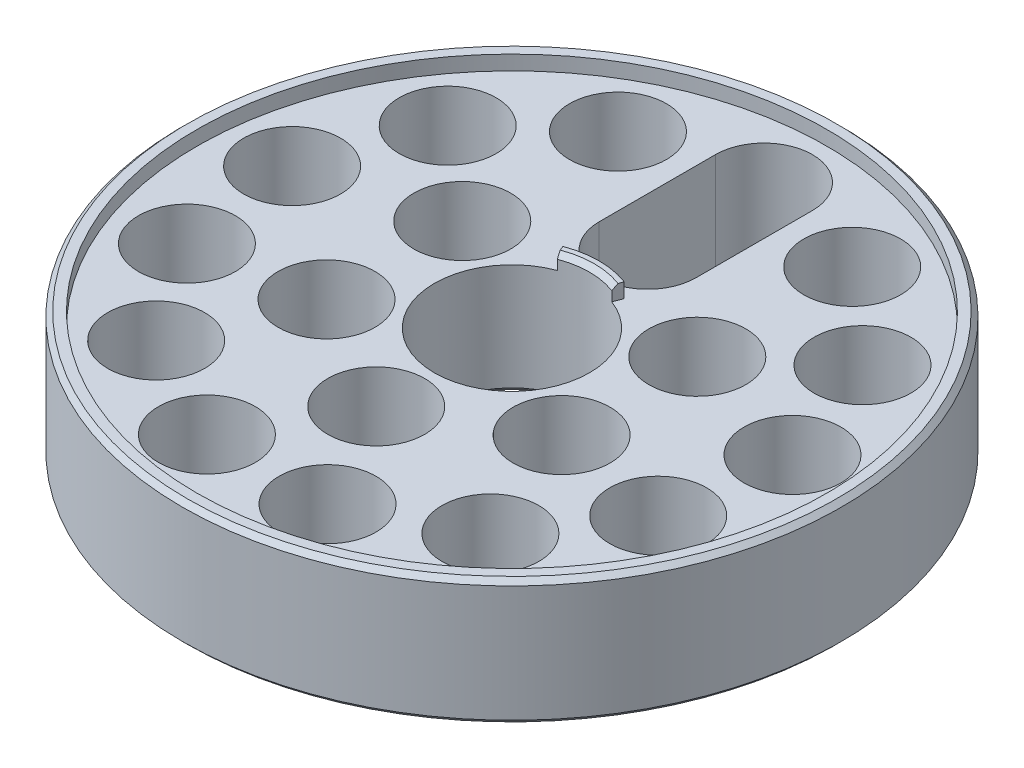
ISO-10303-21;
HEADER;
FILE_DESCRIPTION(('STEP AP214'),'2;1');
FILE_NAME('part.step','',(''),(''),'','','');
FILE_SCHEMA(('AUTOMOTIVE_DESIGN { 1 0 10303 214 1 1 1 1 }'));
ENDSEC;
DATA;
#1=APPLICATION_CONTEXT('core data for automotive mechanical design processes');
#2=APPLICATION_PROTOCOL_DEFINITION('international standard','automotive_design',2000,#1);
#3=PRODUCT_CONTEXT('',#1,'mechanical');
#4=PRODUCT('Part','Part','',(#3));
#5=PRODUCT_RELATED_PRODUCT_CATEGORY('part','',(#4));
#6=PRODUCT_DEFINITION_FORMATION('','',#4);
#7=PRODUCT_DEFINITION_CONTEXT('part definition',#1,'design');
#8=PRODUCT_DEFINITION('design','',#6,#7);
#9=PRODUCT_DEFINITION_SHAPE('','',#8);
#10=(LENGTH_UNIT() NAMED_UNIT(*) SI_UNIT(.MILLI.,.METRE.));
#11=(NAMED_UNIT(*) PLANE_ANGLE_UNIT() SI_UNIT($,.RADIAN.));
#12=(NAMED_UNIT(*) SI_UNIT($,.STERADIAN.) SOLID_ANGLE_UNIT());
#13=UNCERTAINTY_MEASURE_WITH_UNIT(LENGTH_MEASURE(1.E-05),#10,'distance_accuracy_value','');
#14=(GEOMETRIC_REPRESENTATION_CONTEXT(3) GLOBAL_UNCERTAINTY_ASSIGNED_CONTEXT((#13)) GLOBAL_UNIT_ASSIGNED_CONTEXT((#10,
#11,#12)) REPRESENTATION_CONTEXT('',''));
#15=CARTESIAN_POINT('',(0.,0.,0.));
#16=DIRECTION('',(0.,0.,1.));
#17=DIRECTION('',(1.,0.,0.));
#18=AXIS2_PLACEMENT_3D('',#15,#16,#17);
#19=CARTESIAN_POINT('',(0.,0.,0.));
#20=DIRECTION('',(0.,1.,0.));
#21=DIRECTION('',(0.,0.,1.));
#22=AXIS2_PLACEMENT_3D('',#19,#20,#21);
#23=PLANE('',#22);
#24=DIRECTION('',(0.351123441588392,0.,0.936329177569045));
#25=VECTOR('',#24,1.);
#26=CARTESIAN_POINT('',(-2.80898753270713,0.,-7.49063342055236));
#27=LINE('',#26,#25);
#28=CARTESIAN_POINT('',(-3.16011097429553,0.,-8.4269625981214));
#29=VERTEX_POINT('',#28);
#30=CARTESIAN_POINT('',(-2.98454925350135,0.,-7.95879800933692));
#31=VERTEX_POINT('',#30);
#32=EDGE_CURVE('E191',#29,#31,#27,.T.);
#33=ORIENTED_EDGE('',*,*,#32,.T.);
#34=CARTESIAN_POINT('',(0.,0.,0.));
#35=DIRECTION('',(0.,1.,0.));
#36=DIRECTION('',(0.,0.,1.));
#37=AXIS2_PLACEMENT_3D('',#34,#35,#36);
#38=CIRCLE('',#37,8.50000000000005);
#39=CARTESIAN_POINT('',(2.98454925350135,0.,-7.95879800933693));
#40=VERTEX_POINT('',#39);
#41=EDGE_CURVE('E58',#31,#40,#38,.F.);
#42=ORIENTED_EDGE('',*,*,#41,.T.);
#43=DIRECTION('',(0.351123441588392,0.,-0.936329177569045));
#44=VECTOR('',#43,1.);
#45=CARTESIAN_POINT('',(2.80898753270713,0.,-7.49063342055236));
#46=LINE('',#45,#44);
#47=CARTESIAN_POINT('',(3.16011097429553,0.,-8.4269625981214));
#48=VERTEX_POINT('',#47);
#49=EDGE_CURVE('E188',#40,#48,#46,.T.);
#50=ORIENTED_EDGE('',*,*,#49,.T.);
#51=CARTESIAN_POINT('',(0.,0.,0.));
#52=DIRECTION('',(0.,1.,0.));
#53=DIRECTION('',(0.,0.,1.));
#54=AXIS2_PLACEMENT_3D('',#51,#52,#53);
#55=CIRCLE('',#54,9.);
#56=EDGE_CURVE('E193',#48,#29,#55,.T.);
#57=ORIENTED_EDGE('',*,*,#56,.T.);
#58=EDGE_LOOP('',(#33,#42,#50,#57));
#59=FACE_BOUND('',#58,.T.);
#60=ADVANCED_FACE('F33',(#59),#23,.T.);
#61=CARTESIAN_POINT('',(0.,-13.,0.));
#62=DIRECTION('',(0.,1.,0.));
#63=DIRECTION('',(0.,0.,1.));
#64=AXIS2_PLACEMENT_3D('',#61,#62,#63);
#65=CYLINDRICAL_SURFACE('',#64,8.);
#66=CARTESIAN_POINT('',(0.,-12.5000000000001,0.));
#67=DIRECTION('',(0.,1.,0.));
#68=DIRECTION('',(0.,0.,1.));
#69=AXIS2_PLACEMENT_3D('',#66,#67,#68);
#70=CIRCLE('',#69,8.);
#71=CARTESIAN_POINT('',(0.,-12.5000000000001,8.));
#72=VERTEX_POINT('',#71);
#73=EDGE_CURVE('E167',#72,#72,#70,.F.);
#74=ORIENTED_EDGE('',*,*,#73,.T.);
#75=EDGE_LOOP('',(#74));
#76=FACE_BOUND('',#75,.T.);
#77=DIRECTION('',(0.,1.,0.));
#78=VECTOR('',#77,1.);
#79=CARTESIAN_POINT('',(2.80898753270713,-1.5,-7.49063342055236));
#80=LINE('',#79,#78);
#81=CARTESIAN_POINT('',(2.80898753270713,-1.5,-7.49063342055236));
#82=VERTEX_POINT('',#81);
#83=CARTESIAN_POINT('',(2.80898753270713,-0.500000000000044,-7.49063342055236));
#84=VERTEX_POINT('',#83);
#85=EDGE_CURVE('E174',#82,#84,#80,.T.);
#86=ORIENTED_EDGE('',*,*,#85,.T.);
#87=CARTESIAN_POINT('',(0.,-0.500000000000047,0.));
#88=DIRECTION('',(0.,1.,0.));
#89=DIRECTION('',(0.,0.,1.));
#90=AXIS2_PLACEMENT_3D('',#87,#88,#89);
#91=CIRCLE('',#90,8.);
#92=CARTESIAN_POINT('',(-2.80898753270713,-0.500000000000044,-7.49063342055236));
#93=VERTEX_POINT('',#92);
#94=EDGE_CURVE('E164',#84,#93,#91,.T.);
#95=ORIENTED_EDGE('',*,*,#94,.T.);
#96=DIRECTION('',(0.,1.,0.));
#97=VECTOR('',#96,1.);
#98=CARTESIAN_POINT('',(-2.80898753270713,-1.5,-7.49063342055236));
#99=LINE('',#98,#97);
#100=CARTESIAN_POINT('',(-2.80898753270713,-1.5,-7.49063342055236));
#101=VERTEX_POINT('',#100);
#102=EDGE_CURVE('E183',#101,#93,#99,.T.);
#103=ORIENTED_EDGE('',*,*,#102,.F.);
#104=CARTESIAN_POINT('',(0.,-1.5,0.));
#105=DIRECTION('',(0.,1.,0.));
#106=DIRECTION('',(0.,0.,1.));
#107=AXIS2_PLACEMENT_3D('',#104,#105,#106);
#108=CIRCLE('',#107,8.);
#109=EDGE_CURVE('E181',#101,#82,#108,.T.);
#110=ORIENTED_EDGE('',*,*,#109,.T.);
#111=EDGE_LOOP('',(#86,#95,#103,#110));
#112=FACE_BOUND('',#111,.T.);
#113=ADVANCED_FACE('F337',(#76,#112),#65,.F.);
#114=CARTESIAN_POINT('',(0.,-13.,0.));
#115=DIRECTION('',(0.,1.,0.));
#116=DIRECTION('',(0.,0.,1.));
#117=AXIS2_PLACEMENT_3D('',#114,#115,#116);
#118=CYLINDRICAL_SURFACE('',#117,34.);
#119=CARTESIAN_POINT('',(0.,-12.5,0.));
#120=DIRECTION('',(0.,1.,0.));
#121=DIRECTION('',(0.,0.,1.));
#122=AXIS2_PLACEMENT_3D('',#119,#120,#121);
#123=CIRCLE('',#122,34.);
#124=CARTESIAN_POINT('',(0.,-12.5,34.));
#125=VERTEX_POINT('',#124);
#126=EDGE_CURVE('E42',#125,#125,#123,.T.);
#127=CARTESIAN_POINT('',(0.,-0.499999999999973,0.));
#128=DIRECTION('',(0.,1.,0.));
#129=DIRECTION('',(0.,0.,1.));
#130=AXIS2_PLACEMENT_3D('',#127,#128,#129);
#131=CIRCLE('',#130,34.);
#132=CARTESIAN_POINT('',(0.,-0.499999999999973,34.));
#133=VERTEX_POINT('',#132);
#134=EDGE_CURVE('E150',#133,#133,#131,.F.);
#135=CARTESIAN_POINT('',(0.,-12.5,34.));
#136=CARTESIAN_POINT('',(0.,-12.375,34.));
#137=CARTESIAN_POINT('',(0.,-12.25,34.));
#138=CARTESIAN_POINT('',(0.,-12.,34.));
#139=CARTESIAN_POINT('',(0.,-11.875,34.));
#140=CARTESIAN_POINT('',(0.,-11.625,34.));
#141=CARTESIAN_POINT('',(0.,-11.5,34.));
#142=CARTESIAN_POINT('',(0.,-11.25,34.));
#143=CARTESIAN_POINT('',(0.,-11.125,34.));
#144=CARTESIAN_POINT('',(0.,-10.875,34.));
#145=CARTESIAN_POINT('',(0.,-10.75,34.));
#146=CARTESIAN_POINT('',(0.,-10.5,34.));
#147=CARTESIAN_POINT('',(0.,-10.375,34.));
#148=CARTESIAN_POINT('',(0.,-10.125,34.));
#149=CARTESIAN_POINT('',(0.,-9.99999999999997,34.));
#150=CARTESIAN_POINT('',(0.,-9.74999999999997,34.));
#151=CARTESIAN_POINT('',(0.,-9.62499999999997,34.));
#152=CARTESIAN_POINT('',(0.,-9.37499999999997,34.));
#153=CARTESIAN_POINT('',(0.,-9.24999999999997,34.));
#154=CARTESIAN_POINT('',(0.,-8.99999999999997,34.));
#155=CARTESIAN_POINT('',(0.,-8.87499999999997,34.));
#156=CARTESIAN_POINT('',(0.,-8.62499999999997,34.));
#157=CARTESIAN_POINT('',(0.,-8.49999999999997,34.));
#158=CARTESIAN_POINT('',(0.,-8.24999999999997,34.));
#159=CARTESIAN_POINT('',(0.,-8.12499999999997,34.));
#160=CARTESIAN_POINT('',(0.,-7.87499999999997,34.));
#161=CARTESIAN_POINT('',(0.,-7.74999999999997,34.));
#162=CARTESIAN_POINT('',(0.,-7.49999999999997,34.));
#163=CARTESIAN_POINT('',(0.,-7.37499999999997,34.));
#164=CARTESIAN_POINT('',(0.,-7.12499999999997,34.));
#165=CARTESIAN_POINT('',(0.,-6.99999999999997,34.));
#166=CARTESIAN_POINT('',(0.,-6.74999999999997,34.));
#167=CARTESIAN_POINT('',(0.,-6.62499999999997,34.));
#168=CARTESIAN_POINT('',(0.,-6.37499999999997,34.));
#169=CARTESIAN_POINT('',(0.,-6.24999999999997,34.));
#170=CARTESIAN_POINT('',(0.,-5.99999999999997,34.));
#171=CARTESIAN_POINT('',(0.,-5.87499999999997,34.));
#172=CARTESIAN_POINT('',(0.,-5.62499999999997,34.));
#173=CARTESIAN_POINT('',(0.,-5.49999999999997,34.));
#174=CARTESIAN_POINT('',(0.,-5.24999999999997,34.));
#175=CARTESIAN_POINT('',(0.,-5.12499999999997,34.));
#176=CARTESIAN_POINT('',(0.,-4.87499999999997,34.));
#177=CARTESIAN_POINT('',(0.,-4.74999999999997,34.));
#178=CARTESIAN_POINT('',(0.,-4.49999999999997,34.));
#179=CARTESIAN_POINT('',(0.,-4.37499999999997,34.));
#180=CARTESIAN_POINT('',(0.,-4.12499999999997,34.));
#181=CARTESIAN_POINT('',(0.,-3.99999999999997,34.));
#182=CARTESIAN_POINT('',(0.,-3.74999999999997,34.));
#183=CARTESIAN_POINT('',(0.,-3.62499999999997,34.));
#184=CARTESIAN_POINT('',(0.,-3.37499999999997,34.));
#185=CARTESIAN_POINT('',(0.,-3.24999999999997,34.));
#186=CARTESIAN_POINT('',(0.,-2.99999999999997,34.));
#187=CARTESIAN_POINT('',(0.,-2.87499999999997,34.));
#188=CARTESIAN_POINT('',(0.,-2.62499999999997,34.));
#189=CARTESIAN_POINT('',(0.,-2.49999999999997,34.));
#190=CARTESIAN_POINT('',(0.,-2.24999999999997,34.));
#191=CARTESIAN_POINT('',(0.,-2.12499999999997,34.));
#192=CARTESIAN_POINT('',(0.,-1.87499999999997,34.));
#193=CARTESIAN_POINT('',(0.,-1.74999999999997,34.));
#194=CARTESIAN_POINT('',(0.,-1.49999999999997,34.));
#195=CARTESIAN_POINT('',(0.,-1.37499999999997,34.));
#196=CARTESIAN_POINT('',(0.,-1.12499999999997,34.));
#197=CARTESIAN_POINT('',(0.,-0.999999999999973,34.));
#198=CARTESIAN_POINT('',(0.,-0.749999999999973,34.));
#199=CARTESIAN_POINT('',(0.,-0.624999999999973,34.));
#200=CARTESIAN_POINT('',(0.,-0.499999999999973,34.));
#201=B_SPLINE_CURVE_WITH_KNOTS('',3,(#135,#136,#137,#138,#139,#140,#141,#142,#143,#144,#145,
#146,#147,#148,#149,#150,#151,#152,#153,#154,#155,#156,#157,#158,#159,#160,#161,#162,#163,#164,
#165,#166,#167,#168,#169,#170,#171,#172,#173,#174,#175,#176,#177,#178,#179,#180,#181,#182,#183,
#184,#185,#186,#187,#188,#189,#190,#191,#192,#193,#194,#195,#196,#197,#198,#199,#200),
.UNSPECIFIED.,.F.,.F.,(4,2,2,2,2,2,2,2,2,2,2,2,2,2,2,2,2,2,2,2,2,2,2,2,2,2,2,2,2,2,2,2,4),(0.,
0.374999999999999,0.749999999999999,1.125,1.5,1.875,2.25,2.625,3.,3.375,3.75,4.125,4.5,4.875,
5.25,5.625,6.,6.375,6.75,7.125,7.5,7.875,8.25,8.625,9.,9.375,9.75,10.125,10.5,10.875,11.25,
11.625,12.),.UNSPECIFIED.);
#202=EDGE_CURVE('BSEAM343',#125,#133,#201,.T.);
#203=ORIENTED_EDGE('',*,*,#126,.T.);
#204=ORIENTED_EDGE('',*,*,#134,.T.);
#205=ORIENTED_EDGE('',*,*,#202,.T.);
#206=ORIENTED_EDGE('',*,*,#202,.F.);
#207=EDGE_LOOP('',(#203,#205,#204,#206));
#208=FACE_BOUND('',#207,.T.);
#209=ADVANCED_FACE('F343',(#208),#118,.T.);
#210=CARTESIAN_POINT('',(0.,-13.,0.));
#211=DIRECTION('',(0.,1.,0.));
#212=DIRECTION('',(0.,0.,1.));
#213=AXIS2_PLACEMENT_3D('',#210,#211,#212);
#214=PLANE('',#213);
#215=CARTESIAN_POINT('',(0.,-13.,-14.));
#216=DIRECTION('',(0.,1.,0.));
#217=DIRECTION('',(0.,0.,1.));
#218=AXIS2_PLACEMENT_3D('',#215,#216,#217);
#219=CIRCLE('',#218,5.);
#220=CARTESIAN_POINT('',(0.,-13.,-9.));
#221=VERTEX_POINT('',#220);
#222=EDGE_CURVE('E120',#221,#221,#219,.T.);
#223=ORIENTED_EDGE('',*,*,#222,.T.);
#224=EDGE_LOOP('',(#223));
#225=FACE_BOUND('',#224,.T.);
#226=CARTESIAN_POINT('',(0.,-13.,0.));
#227=DIRECTION('',(0.,1.,0.));
#228=DIRECTION('',(0.,0.,1.));
#229=AXIS2_PLACEMENT_3D('',#226,#227,#228);
#230=CIRCLE('',#229,8.49999999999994);
#231=CARTESIAN_POINT('',(0.,-13.,8.49999999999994));
#232=VERTEX_POINT('',#231);
#233=EDGE_CURVE('E153',#232,#232,#230,.T.);
#234=ORIENTED_EDGE('',*,*,#233,.T.);
#235=EDGE_LOOP('',(#234));
#236=FACE_BOUND('',#235,.T.);
#237=CARTESIAN_POINT('',(0.,-13.,0.));
#238=DIRECTION('',(0.,1.,0.));
#239=DIRECTION('',(0.,0.,1.));
#240=AXIS2_PLACEMENT_3D('',#237,#238,#239);
#241=CIRCLE('',#240,33.5);
#242=CARTESIAN_POINT('',(0.,-13.,33.5));
#243=VERTEX_POINT('',#242);
#244=EDGE_CURVE('E156',#243,#243,#241,.F.);
#245=ORIENTED_EDGE('',*,*,#244,.T.);
#246=EDGE_LOOP('',(#245));
#247=FACE_BOUND('',#246,.T.);
#248=ADVANCED_FACE('F323',(#225,#236,#247),#214,.F.);
#249=CARTESIAN_POINT('',(0.,0.,0.));
#250=DIRECTION('',(0.,1.,0.));
#251=DIRECTION('',(0.,0.,1.));
#252=AXIS2_PLACEMENT_3D('',#249,#250,#251);
#253=CIRCLE('',#252,33.5);
#254=CARTESIAN_POINT('',(0.,0.,33.5));
#255=VERTEX_POINT('',#254);
#256=EDGE_CURVE('E11',#255,#255,#253,.T.);
#257=ORIENTED_EDGE('',*,*,#256,.T.);
#258=EDGE_LOOP('',(#257));
#259=FACE_BOUND('',#258,.T.);
#260=CARTESIAN_POINT('',(0.,0.,0.));
#261=DIRECTION('',(0.,1.,0.));
#262=DIRECTION('',(0.,0.,1.));
#263=AXIS2_PLACEMENT_3D('',#260,#261,#262);
#264=CIRCLE('',#263,32.5);
#265=CARTESIAN_POINT('',(0.,0.,32.5));
#266=VERTEX_POINT('',#265);
#267=EDGE_CURVE('E171',#266,#266,#264,.T.);
#268=ORIENTED_EDGE('',*,*,#267,.F.);
#269=EDGE_LOOP('',(#268));
#270=FACE_BOUND('',#269,.T.);
#271=ADVANCED_FACE('F339',(#259,#270),#23,.T.);
#272=CARTESIAN_POINT('',(0.,-1.5,0.));
#273=DIRECTION('',(0.,1.,0.));
#274=DIRECTION('',(0.,0.,1.));
#275=AXIS2_PLACEMENT_3D('',#272,#273,#274);
#276=CYLINDRICAL_SURFACE('',#275,32.5);
#277=CARTESIAN_POINT('',(0.,-1.5,0.));
#278=DIRECTION('',(0.,1.,0.));
#279=DIRECTION('',(0.,0.,1.));
#280=AXIS2_PLACEMENT_3D('',#277,#278,#279);
#281=CIRCLE('',#280,32.5);
#282=CARTESIAN_POINT('',(0.,-1.5,32.5));
#283=VERTEX_POINT('',#282);
#284=EDGE_CURVE('E170',#283,#283,#281,.T.);
#285=ORIENTED_EDGE('',*,*,#284,.F.);
#286=EDGE_LOOP('',(#285));
#287=FACE_BOUND('',#286,.T.);
#288=ORIENTED_EDGE('',*,*,#267,.T.);
#289=EDGE_LOOP('',(#288));
#290=FACE_BOUND('',#289,.T.);
#291=ADVANCED_FACE('F349',(#287,#290),#276,.F.);
#292=CARTESIAN_POINT('',(0.,-1.5,0.));
#293=DIRECTION('',(0.,1.,0.));
#294=DIRECTION('',(0.,0.,1.));
#295=AXIS2_PLACEMENT_3D('',#292,#293,#294);
#296=PLANE('',#295);
#297=CARTESIAN_POINT('',(-12.1243556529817,-1.5,-6.9999999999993));
#298=DIRECTION('',(0.,1.,0.));
#299=DIRECTION('',(0.,0.,1.));
#300=AXIS2_PLACEMENT_3D('',#297,#298,#299);
#301=CIRCLE('',#300,5.00000000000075);
#302=CARTESIAN_POINT('',(-12.1243556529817,-1.5,-1.99999999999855));
#303=VERTEX_POINT('',#302);
#304=EDGE_CURVE('E313',#303,#303,#301,.T.);
#305=ORIENTED_EDGE('',*,*,#304,.F.);
#306=EDGE_LOOP('',(#305));
#307=FACE_BOUND('',#306,.T.);
#308=CARTESIAN_POINT('',(-12.1243556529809,-1.5,7.00000000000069));
#309=DIRECTION('',(0.,1.,0.));
#310=DIRECTION('',(0.,0.,1.));
#311=AXIS2_PLACEMENT_3D('',#308,#309,#310);
#312=CIRCLE('',#311,5.00000000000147);
#313=CARTESIAN_POINT('',(-12.1243556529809,-1.5,12.0000000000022));
#314=VERTEX_POINT('',#313);
#315=EDGE_CURVE('E307',#314,#314,#312,.T.);
#316=ORIENTED_EDGE('',*,*,#315,.F.);
#317=EDGE_LOOP('',(#316));
#318=FACE_BOUND('',#317,.T.);
#319=CARTESIAN_POINT('',(1.58818671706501E-12,-1.5,14.));
#320=DIRECTION('',(0.,1.,0.));
#321=DIRECTION('',(0.,0.,1.));
#322=AXIS2_PLACEMENT_3D('',#319,#320,#321);
#323=CIRCLE('',#322,5.00000000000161);
#324=CARTESIAN_POINT('',(1.58818671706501E-12,-1.5,19.0000000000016));
#325=VERTEX_POINT('',#324);
#326=EDGE_CURVE('E301',#325,#325,#323,.T.);
#327=ORIENTED_EDGE('',*,*,#326,.F.);
#328=EDGE_LOOP('',(#327));
#329=FACE_BOUND('',#328,.T.);
#330=CARTESIAN_POINT('',(12.1243556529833,-1.5,6.99999999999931));
#331=DIRECTION('',(0.,1.,0.));
#332=DIRECTION('',(0.,0.,1.));
#333=AXIS2_PLACEMENT_3D('',#330,#331,#332);
#334=CIRCLE('',#333,5.000000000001);
#335=CARTESIAN_POINT('',(12.1243556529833,-1.5,12.0000000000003));
#336=VERTEX_POINT('',#335);
#337=EDGE_CURVE('E295',#336,#336,#334,.T.);
#338=ORIENTED_EDGE('',*,*,#337,.F.);
#339=EDGE_LOOP('',(#338));
#340=FACE_BOUND('',#339,.T.);
#341=CARTESIAN_POINT('',(12.1243556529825,-1.5,-7.00000000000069));
#342=DIRECTION('',(0.,1.,0.));
#343=DIRECTION('',(0.,0.,1.));
#344=AXIS2_PLACEMENT_3D('',#341,#342,#343);
#345=CIRCLE('',#344,5.00000000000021);
#346=CARTESIAN_POINT('',(12.1243556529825,-1.5,-2.00000000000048));
#347=VERTEX_POINT('',#346);
#348=EDGE_CURVE('E289',#347,#347,#345,.T.);
#349=ORIENTED_EDGE('',*,*,#348,.F.);
#350=EDGE_LOOP('',(#349));
#351=FACE_BOUND('',#350,.T.);
#352=DIRECTION('',(0.,0.,-1.));
#353=VECTOR('',#352,1.);
#354=CARTESIAN_POINT('',(5.00000000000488,-1.5,-26.));
#355=LINE('',#354,#353);
#356=CARTESIAN_POINT('',(5.00000000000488,-1.5,-14.));
#357=VERTEX_POINT('',#356);
#358=CARTESIAN_POINT('',(5.00000000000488,-1.5,-26.));
#359=VERTEX_POINT('',#358);
#360=EDGE_CURVE('E279',#357,#359,#355,.T.);
#361=ORIENTED_EDGE('',*,*,#360,.F.);
#362=CARTESIAN_POINT('',(0.,-1.5,-14.));
#363=DIRECTION('',(0.,1.,0.));
#364=DIRECTION('',(0.,0.,1.));
#365=AXIS2_PLACEMENT_3D('',#362,#363,#364);
#366=CIRCLE('',#365,5.00000000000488);
#367=CARTESIAN_POINT('',(0.,-1.5,-8.99999999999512));
#368=VERTEX_POINT('',#367);
#369=EDGE_CURVE('E127',#368,#357,#366,.T.);
#370=ORIENTED_EDGE('',*,*,#369,.F.);
#371=CARTESIAN_POINT('',(0.,-1.5,0.));
#372=DIRECTION('',(0.,1.,0.));
#373=DIRECTION('',(0.,0.,1.));
#374=AXIS2_PLACEMENT_3D('',#371,#372,#373);
#375=CIRCLE('',#374,9.);
#376=CARTESIAN_POINT('',(3.16011097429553,-1.5,-8.4269625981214));
#377=VERTEX_POINT('',#376);
#378=EDGE_CURVE('E201',#377,#368,#375,.T.);
#379=ORIENTED_EDGE('',*,*,#378,.F.);
#380=DIRECTION('',(0.351123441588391,0.,-0.936329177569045));
#381=VECTOR('',#380,1.);
#382=CARTESIAN_POINT('',(3.,-1.5,-8.));
#383=LINE('',#382,#381);
#384=EDGE_CURVE('E190',#82,#377,#383,.T.);
#385=ORIENTED_EDGE('',*,*,#384,.F.);
#386=ORIENTED_EDGE('',*,*,#109,.F.);
#387=DIRECTION('',(0.351123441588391,0.,0.936329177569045));
#388=VECTOR('',#387,1.);
#389=CARTESIAN_POINT('',(-3.,-1.5,-8.));
#390=LINE('',#389,#388);
#391=CARTESIAN_POINT('',(-3.16011097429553,-1.5,-8.4269625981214));
#392=VERTEX_POINT('',#391);
#393=EDGE_CURVE('E199',#392,#101,#390,.T.);
#394=ORIENTED_EDGE('',*,*,#393,.F.);
#395=EDGE_CURVE('E204',#368,#392,#375,.T.);
#396=ORIENTED_EDGE('',*,*,#395,.F.);
#397=CARTESIAN_POINT('',(-5.00000000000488,-1.5,-14.));
#398=VERTEX_POINT('',#397);
#399=EDGE_CURVE('E281',#398,#368,#366,.T.);
#400=ORIENTED_EDGE('',*,*,#399,.F.);
#401=DIRECTION('',(0.,0.,1.));
#402=VECTOR('',#401,1.);
#403=CARTESIAN_POINT('',(-5.00000000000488,-1.5,-26.));
#404=LINE('',#403,#402);
#405=CARTESIAN_POINT('',(-5.00000000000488,-1.5,-26.));
#406=VERTEX_POINT('',#405);
#407=EDGE_CURVE('E283',#406,#398,#404,.T.);
#408=ORIENTED_EDGE('',*,*,#407,.F.);
#409=CARTESIAN_POINT('',(0.,-1.5,-26.));
#410=DIRECTION('',(0.,1.,0.));
#411=DIRECTION('',(0.,0.,1.));
#412=AXIS2_PLACEMENT_3D('',#409,#410,#411);
#413=CIRCLE('',#412,5.00000000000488);
#414=EDGE_CURVE('E50',#359,#406,#413,.T.);
#415=ORIENTED_EDGE('',*,*,#414,.F.);
#416=EDGE_LOOP('',(#361,#370,#379,#385,#386,#394,#396,#400,#408,#415));
#417=FACE_BOUND('',#416,.T.);
#418=CARTESIAN_POINT('',(-12.0828024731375,-1.5,-23.0218566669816));
#419=DIRECTION('',(0.,1.,0.));
#420=DIRECTION('',(0.,0.,1.));
#421=AXIS2_PLACEMENT_3D('',#418,#419,#420);
#422=CIRCLE('',#421,5.00000000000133);
#423=CARTESIAN_POINT('',(-12.0828024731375,-1.5,-18.0218566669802));
#424=VERTEX_POINT('',#423);
#425=EDGE_CURVE('E273',#424,#424,#422,.T.);
#426=ORIENTED_EDGE('',*,*,#425,.F.);
#427=EDGE_LOOP('',(#426));
#428=FACE_BOUND('',#427,.T.);
#429=CARTESIAN_POINT('',(-21.3975805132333,-1.5,-14.7696834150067));
#430=DIRECTION('',(0.,1.,0.));
#431=DIRECTION('',(0.,0.,1.));
#432=AXIS2_PLACEMENT_3D('',#429,#430,#431);
#433=CIRCLE('',#432,5.00000000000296);
#434=CARTESIAN_POINT('',(-21.3975805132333,-1.5,-9.76968341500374));
#435=VERTEX_POINT('',#434);
#436=EDGE_CURVE('E267',#435,#435,#433,.T.);
#437=ORIENTED_EDGE('',*,*,#436,.F.);
#438=EDGE_LOOP('',(#437));
#439=FACE_BOUND('',#438,.T.);
#440=CARTESIAN_POINT('',(-25.8104307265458,-1.5,-3.13395368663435));
#441=DIRECTION('',(0.,1.,0.));
#442=DIRECTION('',(0.,0.,1.));
#443=AXIS2_PLACEMENT_3D('',#440,#441,#442);
#444=CIRCLE('',#443,5.00000000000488);
#445=CARTESIAN_POINT('',(-25.8104307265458,-1.5,1.86604631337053));
#446=VERTEX_POINT('',#445);
#447=EDGE_CURVE('E261',#446,#446,#444,.T.);
#448=ORIENTED_EDGE('',*,*,#447,.F.);
#449=EDGE_LOOP('',(#448));
#450=FACE_BOUND('',#449,.T.);
#451=CARTESIAN_POINT('',(-24.3104223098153,-1.5,9.21972706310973));
#452=DIRECTION('',(0.,1.,0.));
#453=DIRECTION('',(0.,0.,1.));
#454=AXIS2_PLACEMENT_3D('',#451,#452,#453);
#455=CIRCLE('',#454,5.00000000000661);
#456=CARTESIAN_POINT('',(-24.3104223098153,-1.5,14.2197270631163));
#457=VERTEX_POINT('',#456);
#458=EDGE_CURVE('E255',#457,#457,#455,.T.);
#459=ORIENTED_EDGE('',*,*,#458,.F.);
#460=EDGE_LOOP('',(#459));
#461=FACE_BOUND('',#460,.T.);
#462=CARTESIAN_POINT('',(-17.2411891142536,-1.5,19.4612794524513));
#463=DIRECTION('',(0.,1.,0.));
#464=DIRECTION('',(0.,0.,1.));
#465=AXIS2_PLACEMENT_3D('',#462,#463,#464);
#466=CIRCLE('',#465,5.0000000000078);
#467=CARTESIAN_POINT('',(-17.2411891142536,-1.5,24.4612794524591));
#468=VERTEX_POINT('',#467);
#469=EDGE_CURVE('E249',#468,#468,#466,.T.);
#470=ORIENTED_EDGE('',*,*,#469,.F.);
#471=EDGE_LOOP('',(#470));
#472=FACE_BOUND('',#471,.T.);
#473=CARTESIAN_POINT('',(-6.22220727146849,-1.5,25.2444872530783));
#474=DIRECTION('',(0.,1.,0.));
#475=DIRECTION('',(0.,0.,1.));
#476=AXIS2_PLACEMENT_3D('',#473,#474,#475);
#477=CIRCLE('',#476,5.00000000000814);
#478=CARTESIAN_POINT('',(-6.22220727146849,-1.5,30.2444872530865));
#479=VERTEX_POINT('',#478);
#480=EDGE_CURVE('E243',#479,#479,#477,.T.);
#481=ORIENTED_EDGE('',*,*,#480,.F.);
#482=EDGE_LOOP('',(#481));
#483=FACE_BOUND('',#482,.T.);
#484=CARTESIAN_POINT('',(6.22220727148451,-1.5,25.2444872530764));
#485=DIRECTION('',(0.,1.,0.));
#486=DIRECTION('',(0.,0.,1.));
#487=AXIS2_PLACEMENT_3D('',#484,#485,#486);
#488=CIRCLE('',#487,5.00000000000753);
#489=CARTESIAN_POINT('',(6.22220727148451,-1.5,30.2444872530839));
#490=VERTEX_POINT('',#489);
#491=EDGE_CURVE('E237',#490,#490,#488,.T.);
#492=ORIENTED_EDGE('',*,*,#491,.F.);
#493=EDGE_LOOP('',(#492));
#494=FACE_BOUND('',#493,.T.);
#495=CARTESIAN_POINT('',(17.2411891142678,-1.5,19.4612794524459));
#496=DIRECTION('',(0.,1.,0.));
#497=DIRECTION('',(0.,0.,1.));
#498=AXIS2_PLACEMENT_3D('',#495,#496,#497);
#499=CIRCLE('',#498,5.00000000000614);
#500=CARTESIAN_POINT('',(17.2411891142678,-1.5,24.4612794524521));
#501=VERTEX_POINT('',#500);
#502=EDGE_CURVE('E231',#501,#501,#499,.T.);
#503=ORIENTED_EDGE('',*,*,#502,.F.);
#504=EDGE_LOOP('',(#503));
#505=FACE_BOUND('',#504,.T.);
#506=CARTESIAN_POINT('',(24.3104223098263,-1.5,9.21972706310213));
#507=DIRECTION('',(0.,1.,0.));
#508=DIRECTION('',(0.,0.,1.));
#509=AXIS2_PLACEMENT_3D('',#506,#507,#508);
#510=CIRCLE('',#509,5.00000000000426);
#511=CARTESIAN_POINT('',(24.3104223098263,-1.5,14.2197270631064));
#512=VERTEX_POINT('',#511);
#513=EDGE_CURVE('E225',#512,#512,#510,.T.);
#514=ORIENTED_EDGE('',*,*,#513,.F.);
#515=EDGE_LOOP('',(#514));
#516=FACE_BOUND('',#515,.T.);
#517=CARTESIAN_POINT('',(25.810430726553,-1.5,-3.13395368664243));
#518=DIRECTION('',(0.,1.,0.));
#519=DIRECTION('',(0.,0.,1.));
#520=AXIS2_PLACEMENT_3D('',#517,#518,#519);
#521=CIRCLE('',#520,5.00000000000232);
#522=CARTESIAN_POINT('',(25.810430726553,-1.5,1.86604631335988));
#523=VERTEX_POINT('',#522);
#524=EDGE_CURVE('E219',#523,#523,#521,.T.);
#525=ORIENTED_EDGE('',*,*,#524,.F.);
#526=EDGE_LOOP('',(#525));
#527=FACE_BOUND('',#526,.T.);
#528=CARTESIAN_POINT('',(21.3975805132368,-1.5,-14.7696834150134));
#529=DIRECTION('',(0.,1.,0.));
#530=DIRECTION('',(0.,0.,1.));
#531=AXIS2_PLACEMENT_3D('',#528,#529,#530);
#532=CIRCLE('',#531,5.00000000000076);
#533=CARTESIAN_POINT('',(21.3975805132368,-1.5,-9.76968341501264));
#534=VERTEX_POINT('',#533);
#535=EDGE_CURVE('E213',#534,#534,#532,.T.);
#536=ORIENTED_EDGE('',*,*,#535,.F.);
#537=EDGE_LOOP('',(#536));
#538=FACE_BOUND('',#537,.T.);
#539=CARTESIAN_POINT('',(12.0828024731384,-1.5,-23.0218566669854));
#540=DIRECTION('',(0.,1.,0.));
#541=DIRECTION('',(0.,0.,1.));
#542=AXIS2_PLACEMENT_3D('',#539,#540,#541);
#543=CIRCLE('',#542,4.99999999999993);
#544=CARTESIAN_POINT('',(12.0828024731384,-1.5,-18.0218566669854));
#545=VERTEX_POINT('',#544);
#546=EDGE_CURVE('E207',#545,#545,#543,.T.);
#547=ORIENTED_EDGE('',*,*,#546,.F.);
#548=EDGE_LOOP('',(#547));
#549=FACE_BOUND('',#548,.T.);
#550=ORIENTED_EDGE('',*,*,#284,.T.);
#551=EDGE_LOOP('',(#550));
#552=FACE_BOUND('',#551,.T.);
#553=ADVANCED_FACE('F355',(#307,#318,#329,#340,#351,#417,#428,#439,#450,#461,#472,#483,#494,
#505,#516,#527,#538,#549,#552),#296,.T.);
#554=CARTESIAN_POINT('',(2.80898753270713,-1.5,-7.49063342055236));
#555=DIRECTION('',(0.936329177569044,0.,0.351123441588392));
#556=DIRECTION('',(0.351123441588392,0.,-0.936329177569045));
#557=AXIS2_PLACEMENT_3D('',#554,#555,#556);
#558=PLANE('',#557);
#559=ORIENTED_EDGE('',*,*,#49,.F.);
#560=DIRECTION('',(0.24828176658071,0.707106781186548,-0.662084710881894));
#561=VECTOR('',#560,1.);
#562=CARTESIAN_POINT('',(0.,-8.50000000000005,0.));
#563=LINE('',#562,#561);
#564=EDGE_CURVE('E159',#40,#84,#563,.F.);
#565=ORIENTED_EDGE('',*,*,#564,.T.);
#566=ORIENTED_EDGE('',*,*,#85,.F.);
#567=ORIENTED_EDGE('',*,*,#384,.T.);
#568=DIRECTION('',(0.,1.,0.));
#569=VECTOR('',#568,1.);
#570=CARTESIAN_POINT('',(3.16011097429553,-1.5,-8.4269625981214));
#571=LINE('',#570,#569);
#572=EDGE_CURVE('E177',#377,#48,#571,.T.);
#573=ORIENTED_EDGE('',*,*,#572,.T.);
#574=EDGE_LOOP('',(#559,#565,#566,#567,#573));
#575=FACE_BOUND('',#574,.T.);
#576=ADVANCED_FACE('F417',(#575),#558,.T.);
#577=CARTESIAN_POINT('',(-2.80898753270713,-1.5,-7.49063342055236));
#578=DIRECTION('',(-0.936329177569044,0.,0.351123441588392));
#579=DIRECTION('',(0.351123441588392,0.,0.936329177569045));
#580=AXIS2_PLACEMENT_3D('',#577,#578,#579);
#581=PLANE('',#580);
#582=ORIENTED_EDGE('',*,*,#102,.T.);
#583=DIRECTION('',(0.24828176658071,-0.707106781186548,0.662084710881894));
#584=VECTOR('',#583,1.);
#585=CARTESIAN_POINT('',(0.,-8.50000000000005,0.));
#586=LINE('',#585,#584);
#587=EDGE_CURVE('E162',#93,#31,#586,.F.);
#588=ORIENTED_EDGE('',*,*,#587,.T.);
#589=ORIENTED_EDGE('',*,*,#32,.F.);
#590=DIRECTION('',(0.,1.,0.));
#591=VECTOR('',#590,1.);
#592=CARTESIAN_POINT('',(-3.16011097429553,-1.5,-8.4269625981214));
#593=LINE('',#592,#591);
#594=EDGE_CURVE('E180',#392,#29,#593,.T.);
#595=ORIENTED_EDGE('',*,*,#594,.F.);
#596=ORIENTED_EDGE('',*,*,#393,.T.);
#597=EDGE_LOOP('',(#582,#588,#589,#595,#596));
#598=FACE_BOUND('',#597,.T.);
#599=ADVANCED_FACE('F408',(#598),#581,.T.);
#600=CARTESIAN_POINT('',(0.,-1.5,0.));
#601=DIRECTION('',(0.,1.,0.));
#602=DIRECTION('',(0.,0.,1.));
#603=AXIS2_PLACEMENT_3D('',#600,#601,#602);
#604=CYLINDRICAL_SURFACE('',#603,9.);
#605=ORIENTED_EDGE('',*,*,#56,.F.);
#606=ORIENTED_EDGE('',*,*,#572,.F.);
#607=ORIENTED_EDGE('',*,*,#378,.T.);
#608=ORIENTED_EDGE('',*,*,#395,.T.);
#609=ORIENTED_EDGE('',*,*,#594,.T.);
#610=EDGE_LOOP('',(#605,#606,#607,#608,#609));
#611=FACE_BOUND('',#610,.T.);
#612=ADVANCED_FACE('F386',(#611),#604,.T.);
#613=CARTESIAN_POINT('',(0.,-0.500000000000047,0.));
#614=DIRECTION('',(0.,1.,0.));
#615=DIRECTION('',(0.,0.,1.));
#616=AXIS2_PLACEMENT_3D('',#613,#614,#615);
#617=CONICAL_SURFACE('',#616,8.,0.785398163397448);
#618=ORIENTED_EDGE('',*,*,#564,.F.);
#619=ORIENTED_EDGE('',*,*,#41,.F.);
#620=ORIENTED_EDGE('',*,*,#587,.F.);
#621=ORIENTED_EDGE('',*,*,#94,.F.);
#622=EDGE_LOOP('',(#618,#619,#620,#621));
#623=FACE_BOUND('',#622,.T.);
#624=ADVANCED_FACE('F383',(#623),#617,.F.);
#625=CARTESIAN_POINT('',(0.,-13.,0.));
#626=DIRECTION('',(0.,-1.,0.));
#627=DIRECTION('',(0.,0.,-1.));
#628=AXIS2_PLACEMENT_3D('',#625,#626,#627);
#629=CONICAL_SURFACE('',#628,8.49999999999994,0.785398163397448);
#630=ORIENTED_EDGE('',*,*,#73,.F.);
#631=EDGE_LOOP('',(#630));
#632=FACE_BOUND('',#631,.T.);
#633=ORIENTED_EDGE('',*,*,#233,.F.);
#634=EDGE_LOOP('',(#633));
#635=FACE_BOUND('',#634,.T.);
#636=ADVANCED_FACE('F374',(#632,#635),#629,.F.);
#637=CARTESIAN_POINT('',(0.,-12.5,0.));
#638=DIRECTION('',(0.,1.,0.));
#639=DIRECTION('',(0.,0.,1.));
#640=AXIS2_PLACEMENT_3D('',#637,#638,#639);
#641=CONICAL_SURFACE('',#640,34.,0.785398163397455);
#642=ORIENTED_EDGE('',*,*,#244,.F.);
#643=EDGE_LOOP('',(#642));
#644=FACE_BOUND('',#643,.T.);
#645=ORIENTED_EDGE('',*,*,#126,.F.);
#646=EDGE_LOOP('',(#645));
#647=FACE_BOUND('',#646,.T.);
#648=ADVANCED_FACE('F365',(#644,#647),#641,.T.);
#649=CARTESIAN_POINT('',(0.,0.,0.));
#650=DIRECTION('',(0.,-1.,0.));
#651=DIRECTION('',(0.,0.,-1.));
#652=AXIS2_PLACEMENT_3D('',#649,#650,#651);
#653=CONICAL_SURFACE('',#652,33.5,0.785398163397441);
#654=ORIENTED_EDGE('',*,*,#134,.F.);
#655=EDGE_LOOP('',(#654));
#656=FACE_BOUND('',#655,.T.);
#657=ORIENTED_EDGE('',*,*,#256,.F.);
#658=EDGE_LOOP('',(#657));
#659=FACE_BOUND('',#658,.T.);
#660=ADVANCED_FACE('F35',(#656,#659),#653,.T.);
#661=CARTESIAN_POINT('',(12.0828024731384,-11.5,-23.0218566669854));
#662=DIRECTION('',(0.,1.,0.));
#663=DIRECTION('',(0.,0.,1.));
#664=AXIS2_PLACEMENT_3D('',#661,#662,#663);
#665=CYLINDRICAL_SURFACE('',#664,4.99999999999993);
#666=CARTESIAN_POINT('',(12.0828024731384,-11.5,-23.0218566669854));
#667=DIRECTION('',(0.,1.,0.));
#668=DIRECTION('',(0.,0.,1.));
#669=AXIS2_PLACEMENT_3D('',#666,#667,#668);
#670=CIRCLE('',#669,4.99999999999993);
#671=CARTESIAN_POINT('',(12.0828024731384,-11.5,-18.0218566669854));
#672=VERTEX_POINT('',#671);
#673=EDGE_CURVE('E196',#672,#672,#670,.T.);
#674=ORIENTED_EDGE('',*,*,#673,.F.);
#675=EDGE_LOOP('',(#674));
#676=FACE_BOUND('',#675,.T.);
#677=ORIENTED_EDGE('',*,*,#546,.T.);
#678=EDGE_LOOP('',(#677));
#679=FACE_BOUND('',#678,.T.);
#680=ADVANCED_FACE('F364',(#676,#679),#665,.F.);
#681=CARTESIAN_POINT('',(12.0828024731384,-11.5,-23.0218566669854));
#682=DIRECTION('',(0.,1.,0.));
#683=DIRECTION('',(0.,0.,1.));
#684=AXIS2_PLACEMENT_3D('',#681,#682,#683);
#685=PLANE('',#684);
#686=ORIENTED_EDGE('',*,*,#673,.T.);
#687=EDGE_LOOP('',(#686));
#688=FACE_BOUND('',#687,.T.);
#689=ADVANCED_FACE('F371',(#688),#685,.T.);
#690=CARTESIAN_POINT('',(21.3975805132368,-11.5,-14.7696834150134));
#691=DIRECTION('',(0.,1.,0.));
#692=DIRECTION('',(0.,0.,1.));
#693=AXIS2_PLACEMENT_3D('',#690,#691,#692);
#694=CYLINDRICAL_SURFACE('',#693,5.00000000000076);
#695=CARTESIAN_POINT('',(21.3975805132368,-11.5,-14.7696834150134));
#696=DIRECTION('',(0.,1.,0.));
#697=DIRECTION('',(0.,0.,1.));
#698=AXIS2_PLACEMENT_3D('',#695,#696,#697);
#699=CIRCLE('',#698,5.00000000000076);
#700=CARTESIAN_POINT('',(21.3975805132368,-11.5,-9.76968341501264));
#701=VERTEX_POINT('',#700);
#702=EDGE_CURVE('E210',#701,#701,#699,.T.);
#703=ORIENTED_EDGE('',*,*,#702,.F.);
#704=EDGE_LOOP('',(#703));
#705=FACE_BOUND('',#704,.T.);
#706=ORIENTED_EDGE('',*,*,#535,.T.);
#707=EDGE_LOOP('',(#706));
#708=FACE_BOUND('',#707,.T.);
#709=ADVANCED_FACE('F868',(#705,#708),#694,.F.);
#710=CARTESIAN_POINT('',(21.3975805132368,-11.5,-14.7696834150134));
#711=DIRECTION('',(0.,1.,0.));
#712=DIRECTION('',(0.,0.,1.));
#713=AXIS2_PLACEMENT_3D('',#710,#711,#712);
#714=PLANE('',#713);
#715=ORIENTED_EDGE('',*,*,#702,.T.);
#716=EDGE_LOOP('',(#715));
#717=FACE_BOUND('',#716,.T.);
#718=ADVANCED_FACE('F858',(#717),#714,.T.);
#719=CARTESIAN_POINT('',(25.810430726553,-11.5,-3.13395368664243));
#720=DIRECTION('',(0.,1.,0.));
#721=DIRECTION('',(0.,0.,1.));
#722=AXIS2_PLACEMENT_3D('',#719,#720,#721);
#723=CYLINDRICAL_SURFACE('',#722,5.00000000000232);
#724=CARTESIAN_POINT('',(25.810430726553,-11.5,-3.13395368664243));
#725=DIRECTION('',(0.,1.,0.));
#726=DIRECTION('',(0.,0.,1.));
#727=AXIS2_PLACEMENT_3D('',#724,#725,#726);
#728=CIRCLE('',#727,5.00000000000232);
#729=CARTESIAN_POINT('',(25.810430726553,-11.5,1.86604631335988));
#730=VERTEX_POINT('',#729);
#731=EDGE_CURVE('E216',#730,#730,#728,.T.);
#732=ORIENTED_EDGE('',*,*,#731,.F.);
#733=EDGE_LOOP('',(#732));
#734=FACE_BOUND('',#733,.T.);
#735=ORIENTED_EDGE('',*,*,#524,.T.);
#736=EDGE_LOOP('',(#735));
#737=FACE_BOUND('',#736,.T.);
#738=ADVANCED_FACE('F848',(#734,#737),#723,.F.);
#739=CARTESIAN_POINT('',(25.810430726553,-11.5,-3.13395368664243));
#740=DIRECTION('',(0.,1.,0.));
#741=DIRECTION('',(0.,0.,1.));
#742=AXIS2_PLACEMENT_3D('',#739,#740,#741);
#743=PLANE('',#742);
#744=ORIENTED_EDGE('',*,*,#731,.T.);
#745=EDGE_LOOP('',(#744));
#746=FACE_BOUND('',#745,.T.);
#747=ADVANCED_FACE('F838',(#746),#743,.T.);
#748=CARTESIAN_POINT('',(24.3104223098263,-11.5,9.21972706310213));
#749=DIRECTION('',(0.,1.,0.));
#750=DIRECTION('',(0.,0.,1.));
#751=AXIS2_PLACEMENT_3D('',#748,#749,#750);
#752=CYLINDRICAL_SURFACE('',#751,5.00000000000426);
#753=CARTESIAN_POINT('',(24.3104223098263,-11.5,9.21972706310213));
#754=DIRECTION('',(0.,1.,0.));
#755=DIRECTION('',(0.,0.,1.));
#756=AXIS2_PLACEMENT_3D('',#753,#754,#755);
#757=CIRCLE('',#756,5.00000000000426);
#758=CARTESIAN_POINT('',(24.3104223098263,-11.5,14.2197270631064));
#759=VERTEX_POINT('',#758);
#760=EDGE_CURVE('E222',#759,#759,#757,.T.);
#761=ORIENTED_EDGE('',*,*,#760,.F.);
#762=EDGE_LOOP('',(#761));
#763=FACE_BOUND('',#762,.T.);
#764=ORIENTED_EDGE('',*,*,#513,.T.);
#765=EDGE_LOOP('',(#764));
#766=FACE_BOUND('',#765,.T.);
#767=ADVANCED_FACE('F828',(#763,#766),#752,.F.);
#768=CARTESIAN_POINT('',(24.3104223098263,-11.5,9.21972706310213));
#769=DIRECTION('',(0.,1.,0.));
#770=DIRECTION('',(0.,0.,1.));
#771=AXIS2_PLACEMENT_3D('',#768,#769,#770);
#772=PLANE('',#771);
#773=ORIENTED_EDGE('',*,*,#760,.T.);
#774=EDGE_LOOP('',(#773));
#775=FACE_BOUND('',#774,.T.);
#776=ADVANCED_FACE('F818',(#775),#772,.T.);
#777=CARTESIAN_POINT('',(17.2411891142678,-11.5,19.4612794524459));
#778=DIRECTION('',(0.,1.,0.));
#779=DIRECTION('',(0.,0.,1.));
#780=AXIS2_PLACEMENT_3D('',#777,#778,#779);
#781=CYLINDRICAL_SURFACE('',#780,5.00000000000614);
#782=CARTESIAN_POINT('',(17.2411891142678,-11.5,19.4612794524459));
#783=DIRECTION('',(0.,1.,0.));
#784=DIRECTION('',(0.,0.,1.));
#785=AXIS2_PLACEMENT_3D('',#782,#783,#784);
#786=CIRCLE('',#785,5.00000000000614);
#787=CARTESIAN_POINT('',(17.2411891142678,-11.5,24.4612794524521));
#788=VERTEX_POINT('',#787);
#789=EDGE_CURVE('E228',#788,#788,#786,.T.);
#790=ORIENTED_EDGE('',*,*,#789,.F.);
#791=EDGE_LOOP('',(#790));
#792=FACE_BOUND('',#791,.T.);
#793=ORIENTED_EDGE('',*,*,#502,.T.);
#794=EDGE_LOOP('',(#793));
#795=FACE_BOUND('',#794,.T.);
#796=ADVANCED_FACE('F808',(#792,#795),#781,.F.);
#797=CARTESIAN_POINT('',(17.2411891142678,-11.5,19.4612794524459));
#798=DIRECTION('',(0.,1.,0.));
#799=DIRECTION('',(0.,0.,1.));
#800=AXIS2_PLACEMENT_3D('',#797,#798,#799);
#801=PLANE('',#800);
#802=ORIENTED_EDGE('',*,*,#789,.T.);
#803=EDGE_LOOP('',(#802));
#804=FACE_BOUND('',#803,.T.);
#805=ADVANCED_FACE('F798',(#804),#801,.T.);
#806=CARTESIAN_POINT('',(6.22220727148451,-11.5,25.2444872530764));
#807=DIRECTION('',(0.,1.,0.));
#808=DIRECTION('',(0.,0.,1.));
#809=AXIS2_PLACEMENT_3D('',#806,#807,#808);
#810=CYLINDRICAL_SURFACE('',#809,5.00000000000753);
#811=CARTESIAN_POINT('',(6.22220727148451,-11.5,25.2444872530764));
#812=DIRECTION('',(0.,1.,0.));
#813=DIRECTION('',(0.,0.,1.));
#814=AXIS2_PLACEMENT_3D('',#811,#812,#813);
#815=CIRCLE('',#814,5.00000000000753);
#816=CARTESIAN_POINT('',(6.22220727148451,-11.5,30.2444872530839));
#817=VERTEX_POINT('',#816);
#818=EDGE_CURVE('E234',#817,#817,#815,.T.);
#819=ORIENTED_EDGE('',*,*,#818,.F.);
#820=EDGE_LOOP('',(#819));
#821=FACE_BOUND('',#820,.T.);
#822=ORIENTED_EDGE('',*,*,#491,.T.);
#823=EDGE_LOOP('',(#822));
#824=FACE_BOUND('',#823,.T.);
#825=ADVANCED_FACE('F788',(#821,#824),#810,.F.);
#826=CARTESIAN_POINT('',(6.22220727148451,-11.5,25.2444872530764));
#827=DIRECTION('',(0.,1.,0.));
#828=DIRECTION('',(0.,0.,1.));
#829=AXIS2_PLACEMENT_3D('',#826,#827,#828);
#830=PLANE('',#829);
#831=ORIENTED_EDGE('',*,*,#818,.T.);
#832=EDGE_LOOP('',(#831));
#833=FACE_BOUND('',#832,.T.);
#834=ADVANCED_FACE('F778',(#833),#830,.T.);
#835=CARTESIAN_POINT('',(-6.22220727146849,-11.5,25.2444872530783));
#836=DIRECTION('',(0.,1.,0.));
#837=DIRECTION('',(0.,0.,1.));
#838=AXIS2_PLACEMENT_3D('',#835,#836,#837);
#839=CYLINDRICAL_SURFACE('',#838,5.00000000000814);
#840=CARTESIAN_POINT('',(-6.22220727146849,-11.5,25.2444872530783));
#841=DIRECTION('',(0.,1.,0.));
#842=DIRECTION('',(0.,0.,1.));
#843=AXIS2_PLACEMENT_3D('',#840,#841,#842);
#844=CIRCLE('',#843,5.00000000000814);
#845=CARTESIAN_POINT('',(-6.22220727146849,-11.5,30.2444872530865));
#846=VERTEX_POINT('',#845);
#847=EDGE_CURVE('E240',#846,#846,#844,.T.);
#848=ORIENTED_EDGE('',*,*,#847,.F.);
#849=EDGE_LOOP('',(#848));
#850=FACE_BOUND('',#849,.T.);
#851=ORIENTED_EDGE('',*,*,#480,.T.);
#852=EDGE_LOOP('',(#851));
#853=FACE_BOUND('',#852,.T.);
#854=ADVANCED_FACE('F768',(#850,#853),#839,.F.);
#855=CARTESIAN_POINT('',(-6.22220727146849,-11.5,25.2444872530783));
#856=DIRECTION('',(0.,1.,0.));
#857=DIRECTION('',(0.,0.,1.));
#858=AXIS2_PLACEMENT_3D('',#855,#856,#857);
#859=PLANE('',#858);
#860=ORIENTED_EDGE('',*,*,#847,.T.);
#861=EDGE_LOOP('',(#860));
#862=FACE_BOUND('',#861,.T.);
#863=ADVANCED_FACE('F758',(#862),#859,.T.);
#864=CARTESIAN_POINT('',(-17.2411891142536,-11.5,19.4612794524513));
#865=DIRECTION('',(0.,1.,0.));
#866=DIRECTION('',(0.,0.,1.));
#867=AXIS2_PLACEMENT_3D('',#864,#865,#866);
#868=CYLINDRICAL_SURFACE('',#867,5.0000000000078);
#869=CARTESIAN_POINT('',(-17.2411891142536,-11.5,19.4612794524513));
#870=DIRECTION('',(0.,1.,0.));
#871=DIRECTION('',(0.,0.,1.));
#872=AXIS2_PLACEMENT_3D('',#869,#870,#871);
#873=CIRCLE('',#872,5.0000000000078);
#874=CARTESIAN_POINT('',(-17.2411891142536,-11.5,24.4612794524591));
#875=VERTEX_POINT('',#874);
#876=EDGE_CURVE('E246',#875,#875,#873,.T.);
#877=ORIENTED_EDGE('',*,*,#876,.F.);
#878=EDGE_LOOP('',(#877));
#879=FACE_BOUND('',#878,.T.);
#880=ORIENTED_EDGE('',*,*,#469,.T.);
#881=EDGE_LOOP('',(#880));
#882=FACE_BOUND('',#881,.T.);
#883=ADVANCED_FACE('F748',(#879,#882),#868,.F.);
#884=CARTESIAN_POINT('',(-17.2411891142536,-11.5,19.4612794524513));
#885=DIRECTION('',(0.,1.,0.));
#886=DIRECTION('',(0.,0.,1.));
#887=AXIS2_PLACEMENT_3D('',#884,#885,#886);
#888=PLANE('',#887);
#889=ORIENTED_EDGE('',*,*,#876,.T.);
#890=EDGE_LOOP('',(#889));
#891=FACE_BOUND('',#890,.T.);
#892=ADVANCED_FACE('F738',(#891),#888,.T.);
#893=CARTESIAN_POINT('',(-24.3104223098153,-11.5,9.21972706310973));
#894=DIRECTION('',(0.,1.,0.));
#895=DIRECTION('',(0.,0.,1.));
#896=AXIS2_PLACEMENT_3D('',#893,#894,#895);
#897=CYLINDRICAL_SURFACE('',#896,5.00000000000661);
#898=CARTESIAN_POINT('',(-24.3104223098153,-11.5,9.21972706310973));
#899=DIRECTION('',(0.,1.,0.));
#900=DIRECTION('',(0.,0.,1.));
#901=AXIS2_PLACEMENT_3D('',#898,#899,#900);
#902=CIRCLE('',#901,5.00000000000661);
#903=CARTESIAN_POINT('',(-24.3104223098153,-11.5,14.2197270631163));
#904=VERTEX_POINT('',#903);
#905=EDGE_CURVE('E252',#904,#904,#902,.T.);
#906=ORIENTED_EDGE('',*,*,#905,.F.);
#907=EDGE_LOOP('',(#906));
#908=FACE_BOUND('',#907,.T.);
#909=ORIENTED_EDGE('',*,*,#458,.T.);
#910=EDGE_LOOP('',(#909));
#911=FACE_BOUND('',#910,.T.);
#912=ADVANCED_FACE('F728',(#908,#911),#897,.F.);
#913=CARTESIAN_POINT('',(-24.3104223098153,-11.5,9.21972706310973));
#914=DIRECTION('',(0.,1.,0.));
#915=DIRECTION('',(0.,0.,1.));
#916=AXIS2_PLACEMENT_3D('',#913,#914,#915);
#917=PLANE('',#916);
#918=ORIENTED_EDGE('',*,*,#905,.T.);
#919=EDGE_LOOP('',(#918));
#920=FACE_BOUND('',#919,.T.);
#921=ADVANCED_FACE('F718',(#920),#917,.T.);
#922=CARTESIAN_POINT('',(-25.8104307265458,-11.5,-3.13395368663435));
#923=DIRECTION('',(0.,1.,0.));
#924=DIRECTION('',(0.,0.,1.));
#925=AXIS2_PLACEMENT_3D('',#922,#923,#924);
#926=CYLINDRICAL_SURFACE('',#925,5.00000000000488);
#927=CARTESIAN_POINT('',(-25.8104307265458,-11.5,-3.13395368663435));
#928=DIRECTION('',(0.,1.,0.));
#929=DIRECTION('',(0.,0.,1.));
#930=AXIS2_PLACEMENT_3D('',#927,#928,#929);
#931=CIRCLE('',#930,5.00000000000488);
#932=CARTESIAN_POINT('',(-25.8104307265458,-11.5,1.86604631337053));
#933=VERTEX_POINT('',#932);
#934=EDGE_CURVE('E258',#933,#933,#931,.T.);
#935=ORIENTED_EDGE('',*,*,#934,.F.);
#936=EDGE_LOOP('',(#935));
#937=FACE_BOUND('',#936,.T.);
#938=ORIENTED_EDGE('',*,*,#447,.T.);
#939=EDGE_LOOP('',(#938));
#940=FACE_BOUND('',#939,.T.);
#941=ADVANCED_FACE('F708',(#937,#940),#926,.F.);
#942=CARTESIAN_POINT('',(-25.8104307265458,-11.5,-3.13395368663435));
#943=DIRECTION('',(0.,1.,0.));
#944=DIRECTION('',(0.,0.,1.));
#945=AXIS2_PLACEMENT_3D('',#942,#943,#944);
#946=PLANE('',#945);
#947=ORIENTED_EDGE('',*,*,#934,.T.);
#948=EDGE_LOOP('',(#947));
#949=FACE_BOUND('',#948,.T.);
#950=ADVANCED_FACE('F698',(#949),#946,.T.);
#951=CARTESIAN_POINT('',(-21.3975805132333,-11.5,-14.7696834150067));
#952=DIRECTION('',(0.,1.,0.));
#953=DIRECTION('',(0.,0.,1.));
#954=AXIS2_PLACEMENT_3D('',#951,#952,#953);
#955=CYLINDRICAL_SURFACE('',#954,5.00000000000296);
#956=CARTESIAN_POINT('',(-21.3975805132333,-11.5,-14.7696834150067));
#957=DIRECTION('',(0.,1.,0.));
#958=DIRECTION('',(0.,0.,1.));
#959=AXIS2_PLACEMENT_3D('',#956,#957,#958);
#960=CIRCLE('',#959,5.00000000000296);
#961=CARTESIAN_POINT('',(-21.3975805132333,-11.5,-9.76968341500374));
#962=VERTEX_POINT('',#961);
#963=EDGE_CURVE('E264',#962,#962,#960,.T.);
#964=ORIENTED_EDGE('',*,*,#963,.F.);
#965=EDGE_LOOP('',(#964));
#966=FACE_BOUND('',#965,.T.);
#967=ORIENTED_EDGE('',*,*,#436,.T.);
#968=EDGE_LOOP('',(#967));
#969=FACE_BOUND('',#968,.T.);
#970=ADVANCED_FACE('F688',(#966,#969),#955,.F.);
#971=CARTESIAN_POINT('',(-21.3975805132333,-11.5,-14.7696834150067));
#972=DIRECTION('',(0.,1.,0.));
#973=DIRECTION('',(0.,0.,1.));
#974=AXIS2_PLACEMENT_3D('',#971,#972,#973);
#975=PLANE('',#974);
#976=ORIENTED_EDGE('',*,*,#963,.T.);
#977=EDGE_LOOP('',(#976));
#978=FACE_BOUND('',#977,.T.);
#979=ADVANCED_FACE('F678',(#978),#975,.T.);
#980=CARTESIAN_POINT('',(-12.0828024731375,-11.5,-23.0218566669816));
#981=DIRECTION('',(0.,1.,0.));
#982=DIRECTION('',(0.,0.,1.));
#983=AXIS2_PLACEMENT_3D('',#980,#981,#982);
#984=CYLINDRICAL_SURFACE('',#983,5.00000000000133);
#985=CARTESIAN_POINT('',(-12.0828024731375,-11.5,-23.0218566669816));
#986=DIRECTION('',(0.,1.,0.));
#987=DIRECTION('',(0.,0.,1.));
#988=AXIS2_PLACEMENT_3D('',#985,#986,#987);
#989=CIRCLE('',#988,5.00000000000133);
#990=CARTESIAN_POINT('',(-12.0828024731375,-11.5,-18.0218566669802));
#991=VERTEX_POINT('',#990);
#992=EDGE_CURVE('E270',#991,#991,#989,.T.);
#993=ORIENTED_EDGE('',*,*,#992,.F.);
#994=EDGE_LOOP('',(#993));
#995=FACE_BOUND('',#994,.T.);
#996=ORIENTED_EDGE('',*,*,#425,.T.);
#997=EDGE_LOOP('',(#996));
#998=FACE_BOUND('',#997,.T.);
#999=ADVANCED_FACE('F668',(#995,#998),#984,.F.);
#1000=CARTESIAN_POINT('',(-12.0828024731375,-11.5,-23.0218566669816));
#1001=DIRECTION('',(0.,1.,0.));
#1002=DIRECTION('',(0.,0.,1.));
#1003=AXIS2_PLACEMENT_3D('',#1000,#1001,#1002);
#1004=PLANE('',#1003);
#1005=ORIENTED_EDGE('',*,*,#992,.T.);
#1006=EDGE_LOOP('',(#1005));
#1007=FACE_BOUND('',#1006,.T.);
#1008=ADVANCED_FACE('F659',(#1007),#1004,.T.);
#1009=CARTESIAN_POINT('',(0.,-11.5,-26.));
#1010=DIRECTION('',(0.,1.,0.));
#1011=DIRECTION('',(0.,0.,1.));
#1012=AXIS2_PLACEMENT_3D('',#1009,#1010,#1011);
#1013=CYLINDRICAL_SURFACE('',#1012,5.00000000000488);
#1014=ORIENTED_EDGE('',*,*,#414,.T.);
#1015=DIRECTION('',(0.,1.,0.));
#1016=VECTOR('',#1015,1.);
#1017=CARTESIAN_POINT('',(-5.00000000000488,-11.5,-26.));
#1018=LINE('',#1017,#1016);
#1019=CARTESIAN_POINT('',(-5.00000000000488,-11.5,-26.));
#1020=VERTEX_POINT('',#1019);
#1021=EDGE_CURVE('E136',#1020,#406,#1018,.T.);
#1022=ORIENTED_EDGE('',*,*,#1021,.F.);
#1023=CARTESIAN_POINT('',(0.,-11.5,-26.));
#1024=DIRECTION('',(0.,1.,0.));
#1025=DIRECTION('',(0.,0.,1.));
#1026=AXIS2_PLACEMENT_3D('',#1023,#1024,#1025);
#1027=CIRCLE('',#1026,5.00000000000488);
#1028=CARTESIAN_POINT('',(5.00000000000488,-11.5,-26.));
#1029=VERTEX_POINT('',#1028);
#1030=EDGE_CURVE('E138',#1029,#1020,#1027,.T.);
#1031=ORIENTED_EDGE('',*,*,#1030,.F.);
#1032=DIRECTION('',(0.,1.,0.));
#1033=VECTOR('',#1032,1.);
#1034=CARTESIAN_POINT('',(5.00000000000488,-11.5,-26.));
#1035=LINE('',#1034,#1033);
#1036=EDGE_CURVE('E131',#1029,#359,#1035,.T.);
#1037=ORIENTED_EDGE('',*,*,#1036,.T.);
#1038=EDGE_LOOP('',(#1014,#1022,#1031,#1037));
#1039=FACE_BOUND('',#1038,.T.);
#1040=ADVANCED_FACE('F334',(#1039),#1013,.F.);
#1041=CARTESIAN_POINT('',(5.00000000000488,-11.5,-26.));
#1042=DIRECTION('',(1.,0.,0.));
#1043=DIRECTION('',(0.,0.,-1.));
#1044=AXIS2_PLACEMENT_3D('',#1041,#1042,#1043);
#1045=PLANE('',#1044);
#1046=ORIENTED_EDGE('',*,*,#360,.T.);
#1047=ORIENTED_EDGE('',*,*,#1036,.F.);
#1048=DIRECTION('',(0.,0.,-1.));
#1049=VECTOR('',#1048,1.);
#1050=CARTESIAN_POINT('',(5.00000000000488,-11.5,-26.));
#1051=LINE('',#1050,#1049);
#1052=CARTESIAN_POINT('',(5.,-11.5,-14.));
#1053=VERTEX_POINT('',#1052);
#1054=EDGE_CURVE('E115',#1053,#1029,#1051,.T.);
#1055=ORIENTED_EDGE('',*,*,#1054,.F.);
#1056=DIRECTION('',(0.,1.,0.));
#1057=VECTOR('',#1056,1.);
#1058=CARTESIAN_POINT('',(5.00000000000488,-11.5,-14.));
#1059=LINE('',#1058,#1057);
#1060=EDGE_CURVE('E123',#1053,#357,#1059,.T.);
#1061=ORIENTED_EDGE('',*,*,#1060,.T.);
#1062=EDGE_LOOP('',(#1046,#1047,#1055,#1061));
#1063=FACE_BOUND('',#1062,.T.);
#1064=ADVANCED_FACE('F134',(#1063),#1045,.F.);
#1065=CARTESIAN_POINT('',(0.,-11.5,-14.));
#1066=DIRECTION('',(0.,1.,0.));
#1067=DIRECTION('',(0.,0.,1.));
#1068=AXIS2_PLACEMENT_3D('',#1065,#1066,#1067);
#1069=CYLINDRICAL_SURFACE('',#1068,5.00000000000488);
#1070=ORIENTED_EDGE('',*,*,#399,.T.);
#1071=ORIENTED_EDGE('',*,*,#369,.T.);
#1072=ORIENTED_EDGE('',*,*,#1060,.F.);
#1073=CARTESIAN_POINT('',(0.,-11.5,-14.));
#1074=DIRECTION('',(0.,1.,0.));
#1075=DIRECTION('',(0.,0.,1.));
#1076=AXIS2_PLACEMENT_3D('',#1073,#1074,#1075);
#1077=CIRCLE('',#1076,5.);
#1078=CARTESIAN_POINT('',(-5.00000000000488,-11.5,-14.));
#1079=VERTEX_POINT('',#1078);
#1080=EDGE_CURVE('E110',#1053,#1079,#1077,.T.);
#1081=ORIENTED_EDGE('',*,*,#1080,.T.);
#1082=DIRECTION('',(0.,1.,0.));
#1083=VECTOR('',#1082,1.);
#1084=CARTESIAN_POINT('',(-5.00000000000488,-11.5,-14.));
#1085=LINE('',#1084,#1083);
#1086=EDGE_CURVE('E132',#1079,#398,#1085,.T.);
#1087=ORIENTED_EDGE('',*,*,#1086,.T.);
#1088=EDGE_LOOP('',(#1070,#1071,#1072,#1081,#1087));
#1089=FACE_BOUND('',#1088,.T.);
#1090=ORIENTED_EDGE('',*,*,#222,.F.);
#1091=EDGE_LOOP('',(#1090));
#1092=FACE_BOUND('',#1091,.T.);
#1093=ADVANCED_FACE('F124',(#1089,#1092),#1069,.F.);
#1094=CARTESIAN_POINT('',(-5.00000000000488,-11.5,-26.));
#1095=DIRECTION('',(-1.,0.,0.));
#1096=DIRECTION('',(0.,0.,1.));
#1097=AXIS2_PLACEMENT_3D('',#1094,#1095,#1096);
#1098=PLANE('',#1097);
#1099=ORIENTED_EDGE('',*,*,#407,.T.);
#1100=ORIENTED_EDGE('',*,*,#1086,.F.);
#1101=DIRECTION('',(0.,0.,1.));
#1102=VECTOR('',#1101,1.);
#1103=CARTESIAN_POINT('',(-5.00000000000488,-11.5,-26.));
#1104=LINE('',#1103,#1102);
#1105=EDGE_CURVE('E117',#1020,#1079,#1104,.T.);
#1106=ORIENTED_EDGE('',*,*,#1105,.F.);
#1107=ORIENTED_EDGE('',*,*,#1021,.T.);
#1108=EDGE_LOOP('',(#1099,#1100,#1106,#1107));
#1109=FACE_BOUND('',#1108,.T.);
#1110=ADVANCED_FACE('F326',(#1109),#1098,.F.);
#1111=CARTESIAN_POINT('',(0.,-11.5,-26.));
#1112=DIRECTION('',(0.,1.,0.));
#1113=DIRECTION('',(0.,0.,1.));
#1114=AXIS2_PLACEMENT_3D('',#1111,#1112,#1113);
#1115=PLANE('',#1114);
#1116=ORIENTED_EDGE('',*,*,#1080,.F.);
#1117=ORIENTED_EDGE('',*,*,#1054,.T.);
#1118=ORIENTED_EDGE('',*,*,#1030,.T.);
#1119=ORIENTED_EDGE('',*,*,#1105,.T.);
#1120=EDGE_LOOP('',(#1116,#1117,#1118,#1119));
#1121=FACE_BOUND('',#1120,.T.);
#1122=ADVANCED_FACE('F112',(#1121),#1115,.T.);
#1123=CARTESIAN_POINT('',(12.1243556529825,-11.5,-7.00000000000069));
#1124=DIRECTION('',(0.,1.,0.));
#1125=DIRECTION('',(0.,0.,1.));
#1126=AXIS2_PLACEMENT_3D('',#1123,#1124,#1125);
#1127=CYLINDRICAL_SURFACE('',#1126,5.00000000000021);
#1128=CARTESIAN_POINT('',(12.1243556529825,-11.5,-7.00000000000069));
#1129=DIRECTION('',(0.,1.,0.));
#1130=DIRECTION('',(0.,0.,1.));
#1131=AXIS2_PLACEMENT_3D('',#1128,#1129,#1130);
#1132=CIRCLE('',#1131,5.00000000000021);
#1133=CARTESIAN_POINT('',(12.1243556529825,-11.5,-2.00000000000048));
#1134=VERTEX_POINT('',#1133);
#1135=EDGE_CURVE('E287',#1134,#1134,#1132,.T.);
#1136=ORIENTED_EDGE('',*,*,#1135,.F.);
#1137=EDGE_LOOP('',(#1136));
#1138=FACE_BOUND('',#1137,.T.);
#1139=ORIENTED_EDGE('',*,*,#348,.T.);
#1140=EDGE_LOOP('',(#1139));
#1141=FACE_BOUND('',#1140,.T.);
#1142=ADVANCED_FACE('F539',(#1138,#1141),#1127,.F.);
#1143=CARTESIAN_POINT('',(12.1243556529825,-11.5,-7.00000000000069));
#1144=DIRECTION('',(0.,1.,0.));
#1145=DIRECTION('',(0.,0.,1.));
#1146=AXIS2_PLACEMENT_3D('',#1143,#1144,#1145);
#1147=PLANE('',#1146);
#1148=ORIENTED_EDGE('',*,*,#1135,.T.);
#1149=EDGE_LOOP('',(#1148));
#1150=FACE_BOUND('',#1149,.T.);
#1151=ADVANCED_FACE('F549',(#1150),#1147,.T.);
#1152=CARTESIAN_POINT('',(12.1243556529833,-11.5,6.99999999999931));
#1153=DIRECTION('',(0.,1.,0.));
#1154=DIRECTION('',(0.,0.,1.));
#1155=AXIS2_PLACEMENT_3D('',#1152,#1153,#1154);
#1156=CYLINDRICAL_SURFACE('',#1155,5.000000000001);
#1157=CARTESIAN_POINT('',(12.1243556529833,-11.5,6.99999999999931));
#1158=DIRECTION('',(0.,1.,0.));
#1159=DIRECTION('',(0.,0.,1.));
#1160=AXIS2_PLACEMENT_3D('',#1157,#1158,#1159);
#1161=CIRCLE('',#1160,5.000000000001);
#1162=CARTESIAN_POINT('',(12.1243556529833,-11.5,12.0000000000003));
#1163=VERTEX_POINT('',#1162);
#1164=EDGE_CURVE('E292',#1163,#1163,#1161,.T.);
#1165=ORIENTED_EDGE('',*,*,#1164,.F.);
#1166=EDGE_LOOP('',(#1165));
#1167=FACE_BOUND('',#1166,.T.);
#1168=ORIENTED_EDGE('',*,*,#337,.T.);
#1169=EDGE_LOOP('',(#1168));
#1170=FACE_BOUND('',#1169,.T.);
#1171=ADVANCED_FACE('F557',(#1167,#1170),#1156,.F.);
#1172=CARTESIAN_POINT('',(12.1243556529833,-11.5,6.99999999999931));
#1173=DIRECTION('',(0.,1.,0.));
#1174=DIRECTION('',(0.,0.,1.));
#1175=AXIS2_PLACEMENT_3D('',#1172,#1173,#1174);
#1176=PLANE('',#1175);
#1177=ORIENTED_EDGE('',*,*,#1164,.T.);
#1178=EDGE_LOOP('',(#1177));
#1179=FACE_BOUND('',#1178,.T.);
#1180=ADVANCED_FACE('F565',(#1179),#1176,.T.);
#1181=CARTESIAN_POINT('',(1.58818671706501E-12,-11.5,14.));
#1182=DIRECTION('',(0.,1.,0.));
#1183=DIRECTION('',(0.,0.,1.));
#1184=AXIS2_PLACEMENT_3D('',#1181,#1182,#1183);
#1185=CYLINDRICAL_SURFACE('',#1184,5.00000000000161);
#1186=CARTESIAN_POINT('',(1.58818671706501E-12,-11.5,14.));
#1187=DIRECTION('',(0.,1.,0.));
#1188=DIRECTION('',(0.,0.,1.));
#1189=AXIS2_PLACEMENT_3D('',#1186,#1187,#1188);
#1190=CIRCLE('',#1189,5.00000000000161);
#1191=CARTESIAN_POINT('',(1.58818671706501E-12,-11.5,19.0000000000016));
#1192=VERTEX_POINT('',#1191);
#1193=EDGE_CURVE('E298',#1192,#1192,#1190,.T.);
#1194=ORIENTED_EDGE('',*,*,#1193,.F.);
#1195=EDGE_LOOP('',(#1194));
#1196=FACE_BOUND('',#1195,.T.);
#1197=ORIENTED_EDGE('',*,*,#326,.T.);
#1198=EDGE_LOOP('',(#1197));
#1199=FACE_BOUND('',#1198,.T.);
#1200=ADVANCED_FACE('F573',(#1196,#1199),#1185,.F.);
#1201=CARTESIAN_POINT('',(1.58818671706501E-12,-11.5,14.));
#1202=DIRECTION('',(0.,1.,0.));
#1203=DIRECTION('',(0.,0.,1.));
#1204=AXIS2_PLACEMENT_3D('',#1201,#1202,#1203);
#1205=PLANE('',#1204);
#1206=ORIENTED_EDGE('',*,*,#1193,.T.);
#1207=EDGE_LOOP('',(#1206));
#1208=FACE_BOUND('',#1207,.T.);
#1209=ADVANCED_FACE('F581',(#1208),#1205,.T.);
#1210=CARTESIAN_POINT('',(-12.1243556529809,-11.5,7.00000000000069));
#1211=DIRECTION('',(0.,1.,0.));
#1212=DIRECTION('',(0.,0.,1.));
#1213=AXIS2_PLACEMENT_3D('',#1210,#1211,#1212);
#1214=CYLINDRICAL_SURFACE('',#1213,5.00000000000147);
#1215=CARTESIAN_POINT('',(-12.1243556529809,-11.5,7.00000000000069));
#1216=DIRECTION('',(0.,1.,0.));
#1217=DIRECTION('',(0.,0.,1.));
#1218=AXIS2_PLACEMENT_3D('',#1215,#1216,#1217);
#1219=CIRCLE('',#1218,5.00000000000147);
#1220=CARTESIAN_POINT('',(-12.1243556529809,-11.5,12.0000000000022));
#1221=VERTEX_POINT('',#1220);
#1222=EDGE_CURVE('E304',#1221,#1221,#1219,.T.);
#1223=ORIENTED_EDGE('',*,*,#1222,.F.);
#1224=EDGE_LOOP('',(#1223));
#1225=FACE_BOUND('',#1224,.T.);
#1226=ORIENTED_EDGE('',*,*,#315,.T.);
#1227=EDGE_LOOP('',(#1226));
#1228=FACE_BOUND('',#1227,.T.);
#1229=ADVANCED_FACE('F589',(#1225,#1228),#1214,.F.);
#1230=CARTESIAN_POINT('',(-12.1243556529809,-11.5,7.00000000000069));
#1231=DIRECTION('',(0.,1.,0.));
#1232=DIRECTION('',(0.,0.,1.));
#1233=AXIS2_PLACEMENT_3D('',#1230,#1231,#1232);
#1234=PLANE('',#1233);
#1235=ORIENTED_EDGE('',*,*,#1222,.T.);
#1236=EDGE_LOOP('',(#1235));
#1237=FACE_BOUND('',#1236,.T.);
#1238=ADVANCED_FACE('F597',(#1237),#1234,.T.);
#1239=CARTESIAN_POINT('',(-12.1243556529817,-11.5,-6.9999999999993));
#1240=DIRECTION('',(0.,1.,0.));
#1241=DIRECTION('',(0.,0.,1.));
#1242=AXIS2_PLACEMENT_3D('',#1239,#1240,#1241);
#1243=CYLINDRICAL_SURFACE('',#1242,5.00000000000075);
#1244=CARTESIAN_POINT('',(-12.1243556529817,-11.5,-6.9999999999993));
#1245=DIRECTION('',(0.,1.,0.));
#1246=DIRECTION('',(0.,0.,1.));
#1247=AXIS2_PLACEMENT_3D('',#1244,#1245,#1246);
#1248=CIRCLE('',#1247,5.00000000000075);
#1249=CARTESIAN_POINT('',(-12.1243556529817,-11.5,-1.99999999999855));
#1250=VERTEX_POINT('',#1249);
#1251=EDGE_CURVE('E310',#1250,#1250,#1248,.T.);
#1252=ORIENTED_EDGE('',*,*,#1251,.F.);
#1253=EDGE_LOOP('',(#1252));
#1254=FACE_BOUND('',#1253,.T.);
#1255=ORIENTED_EDGE('',*,*,#304,.T.);
#1256=EDGE_LOOP('',(#1255));
#1257=FACE_BOUND('',#1256,.T.);
#1258=ADVANCED_FACE('F605',(#1254,#1257),#1243,.F.);
#1259=CARTESIAN_POINT('',(-12.1243556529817,-11.5,-6.9999999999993));
#1260=DIRECTION('',(0.,1.,0.));
#1261=DIRECTION('',(0.,0.,1.));
#1262=AXIS2_PLACEMENT_3D('',#1259,#1260,#1261);
#1263=PLANE('',#1262);
#1264=ORIENTED_EDGE('',*,*,#1251,.T.);
#1265=EDGE_LOOP('',(#1264));
#1266=FACE_BOUND('',#1265,.T.);
#1267=ADVANCED_FACE('F512',(#1266),#1263,.T.);
#1268=CLOSED_SHELL('',(#60,#113,#209,#248,#271,#291,#553,#576,#599,#612,#624,#636,#648,#660,
#680,#689,#709,#718,#738,#747,#767,#776,#796,#805,#825,#834,#854,#863,#883,#892,#912,#921,#941,
#950,#970,#979,#999,#1008,#1040,#1064,#1093,#1110,#1122,#1142,#1151,#1171,#1180,#1200,#1209,
#1229,#1238,#1258,#1267));
#1269=MANIFOLD_SOLID_BREP('B2',#1268);
#1270=ADVANCED_BREP_SHAPE_REPRESENTATION('',(#18,#1269),#14);
#1271=SHAPE_DEFINITION_REPRESENTATION(#9,#1270);
ENDSEC;
END-ISO-10303-21;
